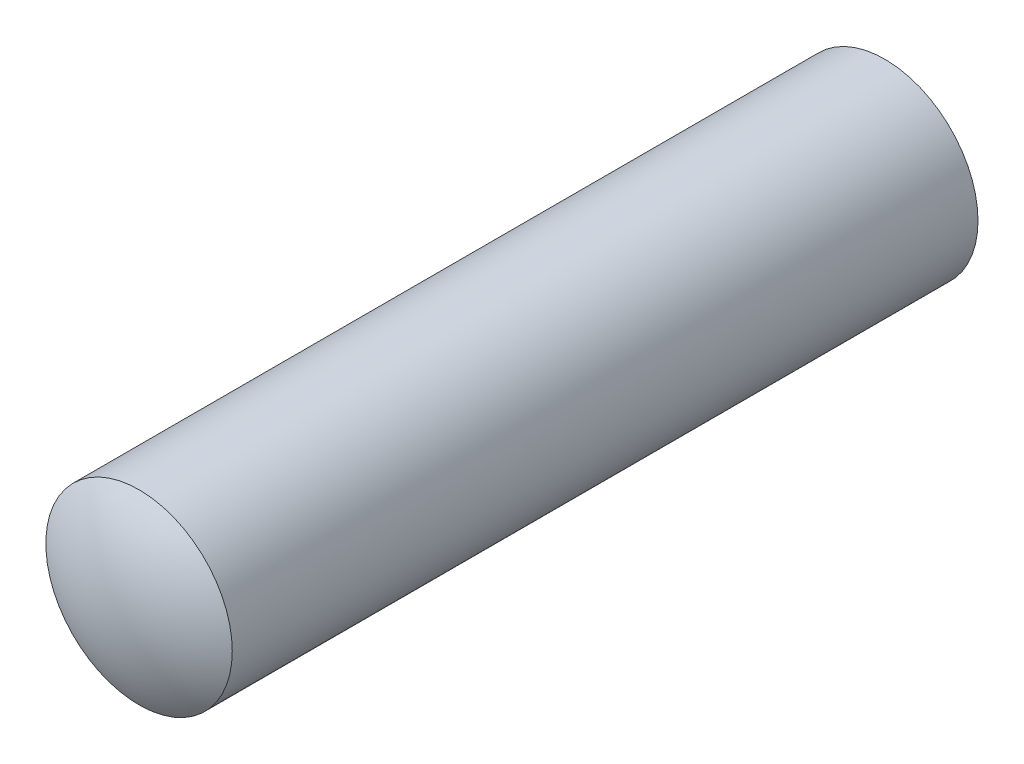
ISO-10303-21;
HEADER;
FILE_DESCRIPTION(('STEP AP214'),'2;1');
FILE_NAME('part.step','',(''),(''),'','','');
FILE_SCHEMA(('AUTOMOTIVE_DESIGN { 1 0 10303 214 1 1 1 1 }'));
ENDSEC;
DATA;
#1=APPLICATION_CONTEXT('core data for automotive mechanical design processes');
#2=APPLICATION_PROTOCOL_DEFINITION('international standard','automotive_design',2000,#1);
#3=PRODUCT_CONTEXT('',#1,'mechanical');
#4=PRODUCT('Part','Part','',(#3));
#5=PRODUCT_RELATED_PRODUCT_CATEGORY('part','',(#4));
#6=PRODUCT_DEFINITION_FORMATION('','',#4);
#7=PRODUCT_DEFINITION_CONTEXT('part definition',#1,'design');
#8=PRODUCT_DEFINITION('design','',#6,#7);
#9=PRODUCT_DEFINITION_SHAPE('','',#8);
#10=(LENGTH_UNIT() NAMED_UNIT(*) SI_UNIT(.MILLI.,.METRE.));
#11=(NAMED_UNIT(*) PLANE_ANGLE_UNIT() SI_UNIT($,.RADIAN.));
#12=(NAMED_UNIT(*) SI_UNIT($,.STERADIAN.) SOLID_ANGLE_UNIT());
#13=UNCERTAINTY_MEASURE_WITH_UNIT(LENGTH_MEASURE(1.E-05),#10,'distance_accuracy_value','');
#14=(GEOMETRIC_REPRESENTATION_CONTEXT(3) GLOBAL_UNCERTAINTY_ASSIGNED_CONTEXT((#13)) GLOBAL_UNIT_ASSIGNED_CONTEXT((#10,
#11,#12)) REPRESENTATION_CONTEXT('',''));
#15=CARTESIAN_POINT('',(0.,0.,0.));
#16=DIRECTION('',(0.,0.,1.));
#17=DIRECTION('',(1.,0.,0.));
#18=AXIS2_PLACEMENT_3D('',#15,#16,#17);
#19=CARTESIAN_POINT('',(0.,0.,10.));
#20=DIRECTION('',(0.,0.,-1.));
#21=DIRECTION('',(-1.,0.,0.));
#22=AXIS2_PLACEMENT_3D('',#19,#20,#21);
#23=CYLINDRICAL_SURFACE('',#22,2.5);
#24=CARTESIAN_POINT('',(0.,0.,10.));
#25=DIRECTION('',(0.,0.,1.));
#26=DIRECTION('',(1.,0.,0.));
#27=AXIS2_PLACEMENT_3D('',#24,#25,#26);
#28=CIRCLE('',#27,2.5);
#29=CARTESIAN_POINT('',(2.5,0.,10.));
#30=VERTEX_POINT('',#29);
#31=EDGE_CURVE('E10',#30,#30,#28,.T.);
#32=ORIENTED_EDGE('',*,*,#31,.F.);
#33=EDGE_LOOP('',(#32));
#34=FACE_BOUND('',#33,.T.);
#35=CARTESIAN_POINT('',(0.,0.,-10.));
#36=DIRECTION('',(0.,0.,1.));
#37=DIRECTION('',(1.,0.,0.));
#38=AXIS2_PLACEMENT_3D('',#35,#36,#37);
#39=CIRCLE('',#38,2.5);
#40=CARTESIAN_POINT('',(2.5,0.,-10.));
#41=VERTEX_POINT('',#40);
#42=EDGE_CURVE('E37',#41,#41,#39,.T.);
#43=ORIENTED_EDGE('',*,*,#42,.T.);
#44=EDGE_LOOP('',(#43));
#45=FACE_BOUND('',#44,.T.);
#46=ADVANCED_FACE('F30',(#34,#45),#23,.T.);
#47=CARTESIAN_POINT('',(0.,0.,6.20833333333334));
#48=DIRECTION('',(0.,0.,1.));
#49=DIRECTION('',(1.,0.,0.));
#50=AXIS2_PLACEMENT_3D('',#47,#48,#49);
#51=SPHERICAL_SURFACE('',#50,4.54166666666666);
#52=ORIENTED_EDGE('',*,*,#31,.T.);
#53=EDGE_LOOP('',(#52));
#54=FACE_BOUND('',#53,.T.);
#55=ADVANCED_FACE('F32',(#54),#51,.T.);
#56=CARTESIAN_POINT('',(0.,0.,-6.20833333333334));
#57=DIRECTION('',(0.,0.,1.));
#58=DIRECTION('',(1.,0.,0.));
#59=AXIS2_PLACEMENT_3D('',#56,#57,#58);
#60=SPHERICAL_SURFACE('',#59,4.54166666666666);
#61=ORIENTED_EDGE('',*,*,#42,.F.);
#62=EDGE_LOOP('',(#61));
#63=FACE_BOUND('',#62,.T.);
#64=ADVANCED_FACE('F44',(#63),#60,.T.);
#65=CLOSED_SHELL('',(#46,#55,#64));
#66=MANIFOLD_SOLID_BREP('B2',#65);
#67=ADVANCED_BREP_SHAPE_REPRESENTATION('',(#18,#66),#14);
#68=SHAPE_DEFINITION_REPRESENTATION(#9,#67);
ENDSEC;
END-ISO-10303-21;
